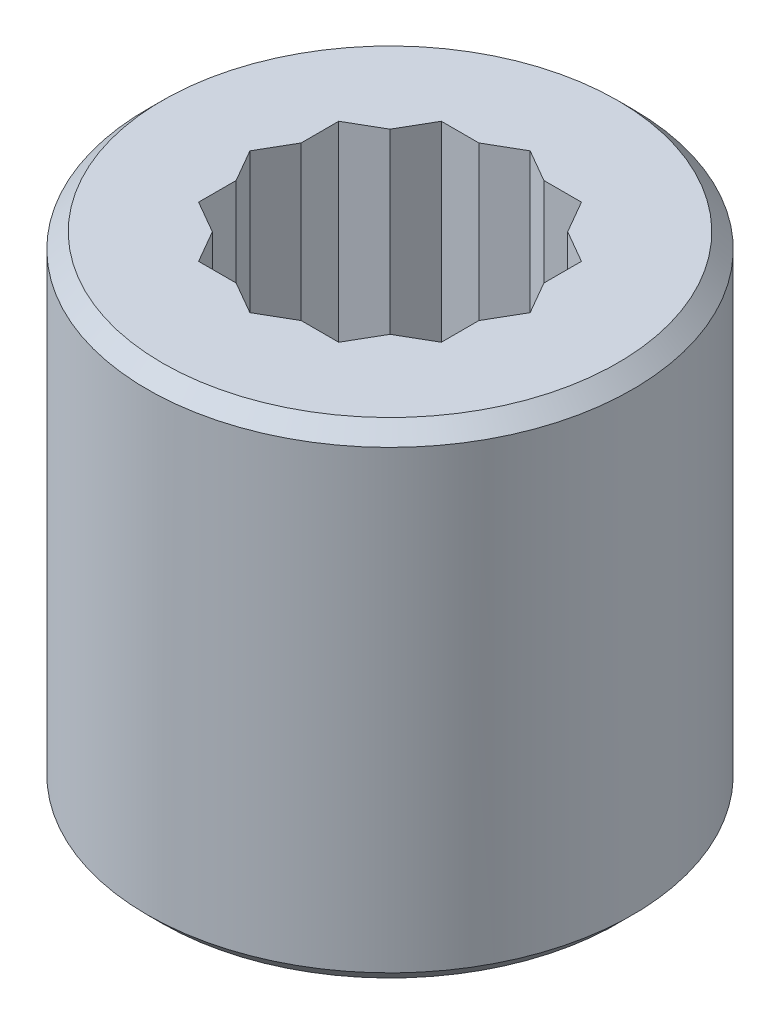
from build123d import *

# Parameters (mm, degrees)
SKETCH1_R        = 12.7
CYLINDER_DEPTH   = 25.4
F_6_POINT_DEPTH  = 12.7
F_12_POINT_DEPTH = 12.7
DRIVE_REACH      = 33.109
SKETCH4_W        = 6.35
SKETCH4_H        = 6.35
CHAMFER1_SIZE    = 0.79375


with BuildPart() as part:
    # Sketch1 → Cylinder (new body)
    with BuildSketch(Plane(origin=(0, 0, 0), x_dir=(1, 0, 0), z_dir=(0, 1, 0))):
        with Locations(Location((0, 0, 0), (0, 0, 270))):
            Circle(SKETCH1_R)
    extrude(amount=CYLINDER_DEPTH)

    # Sketch2 → 6 Point (cut)
    with BuildSketch(Plane(origin=(0, 25.4, 0), x_dir=(-1, 0, 0), z_dir=(0, 1, 0))):
        Polygon((-7.332348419, 0), (-3.666174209, -6.35), (3.666174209, -6.35), (7.332348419, 0), (3.666174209, 6.35), (-3.666174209, 6.35), align=None)
    extrude(amount=-F_6_POINT_DEPTH, mode=Mode.SUBTRACT)

    # Sketch3 → 12 Point (cut)
    with BuildSketch(Plane(origin=(-3.872018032, 25.4, 9.384979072), x_dir=(-1, 0, 0), z_dir=(0, 1, 0))):
        Polygon((-10.222018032, -13.051153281), (-3.872018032, -16.71732749), (2.477981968, -13.051153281), (2.477981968, -5.718804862), (-3.872018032, -2.052630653), (-10.222018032, -5.718804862), align=None)
    extrude(amount=-F_12_POINT_DEPTH, mode=Mode.SUBTRACT)

    # Sketch4 → Drive (cut, up to next)
    with BuildSketch(Plane.XZ, mode=Mode.PRIVATE) as drive_sk1:
        Rectangle(SKETCH4_W, SKETCH4_H)
    drive_tool1 = extrude(drive_sk1.sketch, amount=-DRIVE_REACH, mode=Mode.PRIVATE) & part.part
    add(drive_tool1.solids().sort_by_distance((0, 0, 0))[0], mode=Mode.SUBTRACT)

    # Chamfer1
    chamfer1_edges = [part.edges().sort_by_distance(p)[0] for p in [
        (0, 0, -12.7),
        (0, 25.4, -12.7),
    ]]
    chamfer(chamfer1_edges, length=CHAMFER1_SIZE)


solid = part.part
